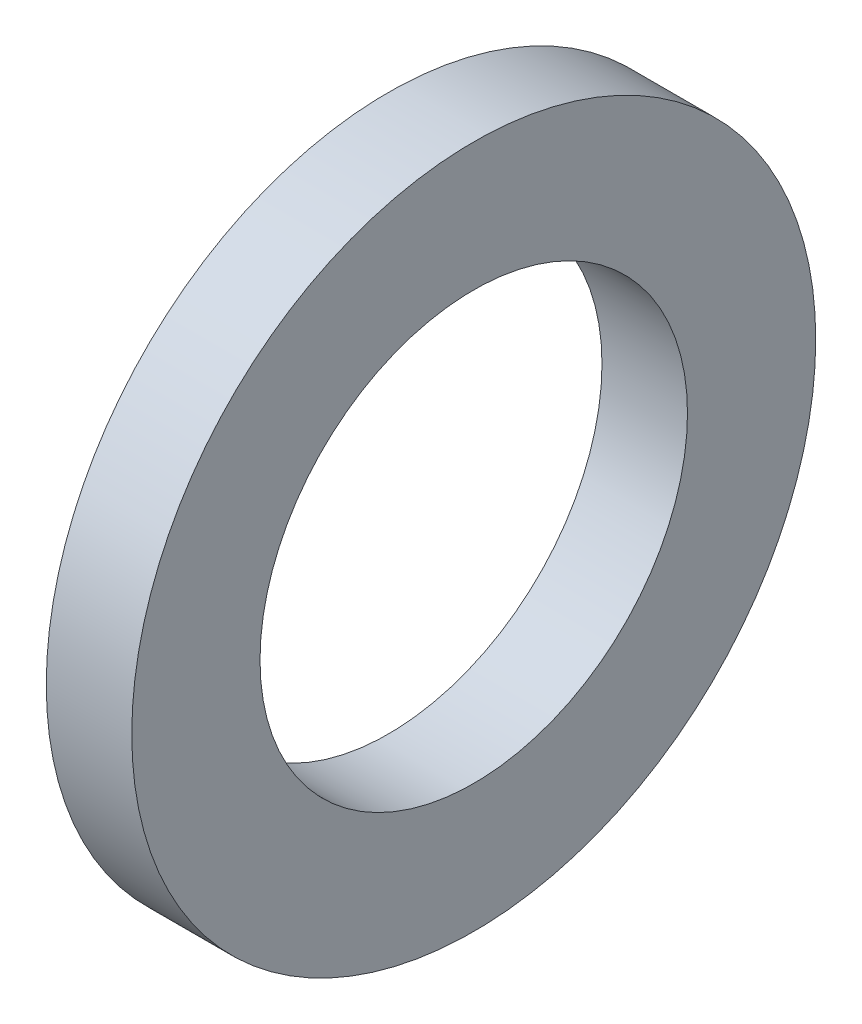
ISO-10303-21;
HEADER;
FILE_DESCRIPTION(('STEP AP214'),'2;1');
FILE_NAME('part.step','',(''),(''),'','','');
FILE_SCHEMA(('AUTOMOTIVE_DESIGN { 1 0 10303 214 1 1 1 1 }'));
ENDSEC;
DATA;
#1=APPLICATION_CONTEXT('core data for automotive mechanical design processes');
#2=APPLICATION_PROTOCOL_DEFINITION('international standard','automotive_design',2000,#1);
#3=PRODUCT_CONTEXT('',#1,'mechanical');
#4=PRODUCT('Part','Part','',(#3));
#5=PRODUCT_RELATED_PRODUCT_CATEGORY('part','',(#4));
#6=PRODUCT_DEFINITION_FORMATION('','',#4);
#7=PRODUCT_DEFINITION_CONTEXT('part definition',#1,'design');
#8=PRODUCT_DEFINITION('design','',#6,#7);
#9=PRODUCT_DEFINITION_SHAPE('','',#8);
#10=(LENGTH_UNIT() NAMED_UNIT(*) SI_UNIT(.MILLI.,.METRE.));
#11=(NAMED_UNIT(*) PLANE_ANGLE_UNIT() SI_UNIT($,.RADIAN.));
#12=(NAMED_UNIT(*) SI_UNIT($,.STERADIAN.) SOLID_ANGLE_UNIT());
#13=UNCERTAINTY_MEASURE_WITH_UNIT(LENGTH_MEASURE(1.E-05),#10,'distance_accuracy_value','');
#14=(GEOMETRIC_REPRESENTATION_CONTEXT(3) GLOBAL_UNCERTAINTY_ASSIGNED_CONTEXT((#13)) GLOBAL_UNIT_ASSIGNED_CONTEXT((#10,
#11,#12)) REPRESENTATION_CONTEXT('',''));
#15=CARTESIAN_POINT('',(0.,0.,0.));
#16=DIRECTION('',(0.,0.,1.));
#17=DIRECTION('',(1.,0.,0.));
#18=AXIS2_PLACEMENT_3D('',#15,#16,#17);
#19=CARTESIAN_POINT('',(-3.175,0.,-12.7));
#20=DIRECTION('',(-1.,0.,0.));
#21=DIRECTION('',(0.,0.,1.));
#22=AXIS2_PLACEMENT_3D('',#19,#20,#21);
#23=PLANE('',#22);
#24=CARTESIAN_POINT('',(-3.175,0.,0.));
#25=DIRECTION('',(1.,0.,0.));
#26=DIRECTION('',(0.,0.,-1.));
#27=AXIS2_PLACEMENT_3D('',#24,#25,#26);
#28=CIRCLE('',#27,7.9375);
#29=CARTESIAN_POINT('',(-3.175,0.,-7.9375));
#30=VERTEX_POINT('',#29);
#31=EDGE_CURVE('E10',#30,#30,#28,.T.);
#32=ORIENTED_EDGE('',*,*,#31,.T.);
#33=EDGE_LOOP('',(#32));
#34=FACE_BOUND('',#33,.T.);
#35=CARTESIAN_POINT('',(-3.175,0.,0.));
#36=DIRECTION('',(1.,0.,0.));
#37=DIRECTION('',(0.,0.,-1.));
#38=AXIS2_PLACEMENT_3D('',#35,#36,#37);
#39=CIRCLE('',#38,12.7);
#40=CARTESIAN_POINT('',(-3.175,0.,-12.7));
#41=VERTEX_POINT('',#40);
#42=EDGE_CURVE('E45',#41,#41,#39,.T.);
#43=ORIENTED_EDGE('',*,*,#42,.F.);
#44=EDGE_LOOP('',(#43));
#45=FACE_BOUND('',#44,.T.);
#46=ADVANCED_FACE('F31',(#34,#45),#23,.T.);
#47=CARTESIAN_POINT('',(0.,0.,0.));
#48=DIRECTION('',(1.,0.,0.));
#49=DIRECTION('',(0.,0.,-1.));
#50=AXIS2_PLACEMENT_3D('',#47,#48,#49);
#51=CYLINDRICAL_SURFACE('',#50,7.9375);
#52=CARTESIAN_POINT('',(0.,0.,0.));
#53=DIRECTION('',(1.,0.,0.));
#54=DIRECTION('',(0.,0.,-1.));
#55=AXIS2_PLACEMENT_3D('',#52,#53,#54);
#56=CIRCLE('',#55,7.9375);
#57=CARTESIAN_POINT('',(0.,0.,-7.9375));
#58=VERTEX_POINT('',#57);
#59=EDGE_CURVE('E37',#58,#58,#56,.T.);
#60=ORIENTED_EDGE('',*,*,#59,.T.);
#61=EDGE_LOOP('',(#60));
#62=FACE_BOUND('',#61,.T.);
#63=ORIENTED_EDGE('',*,*,#31,.F.);
#64=EDGE_LOOP('',(#63));
#65=FACE_BOUND('',#64,.T.);
#66=ADVANCED_FACE('F55',(#62,#65),#51,.F.);
#67=CARTESIAN_POINT('',(0.,0.,-7.9375));
#68=DIRECTION('',(1.,0.,0.));
#69=DIRECTION('',(0.,0.,-1.));
#70=AXIS2_PLACEMENT_3D('',#67,#68,#69);
#71=PLANE('',#70);
#72=CARTESIAN_POINT('',(0.,0.,0.));
#73=DIRECTION('',(1.,0.,0.));
#74=DIRECTION('',(0.,0.,-1.));
#75=AXIS2_PLACEMENT_3D('',#72,#73,#74);
#76=CIRCLE('',#75,12.7);
#77=CARTESIAN_POINT('',(0.,0.,-12.7));
#78=VERTEX_POINT('',#77);
#79=EDGE_CURVE('E41',#78,#78,#76,.T.);
#80=ORIENTED_EDGE('',*,*,#79,.T.);
#81=EDGE_LOOP('',(#80));
#82=FACE_BOUND('',#81,.T.);
#83=ORIENTED_EDGE('',*,*,#59,.F.);
#84=EDGE_LOOP('',(#83));
#85=FACE_BOUND('',#84,.T.);
#86=ADVANCED_FACE('F59',(#82,#85),#71,.T.);
#87=CARTESIAN_POINT('',(0.,0.,0.));
#88=DIRECTION('',(1.,0.,0.));
#89=DIRECTION('',(0.,0.,-1.));
#90=AXIS2_PLACEMENT_3D('',#87,#88,#89);
#91=CYLINDRICAL_SURFACE('',#90,12.7);
#92=ORIENTED_EDGE('',*,*,#42,.T.);
#93=EDGE_LOOP('',(#92));
#94=FACE_BOUND('',#93,.T.);
#95=ORIENTED_EDGE('',*,*,#79,.F.);
#96=EDGE_LOOP('',(#95));
#97=FACE_BOUND('',#96,.T.);
#98=ADVANCED_FACE('F51',(#94,#97),#91,.T.);
#99=CLOSED_SHELL('',(#46,#66,#86,#98));
#100=MANIFOLD_SOLID_BREP('B2',#99);
#101=ADVANCED_BREP_SHAPE_REPRESENTATION('',(#18,#100),#14);
#102=SHAPE_DEFINITION_REPRESENTATION(#9,#101);
ENDSEC;
END-ISO-10303-21;
